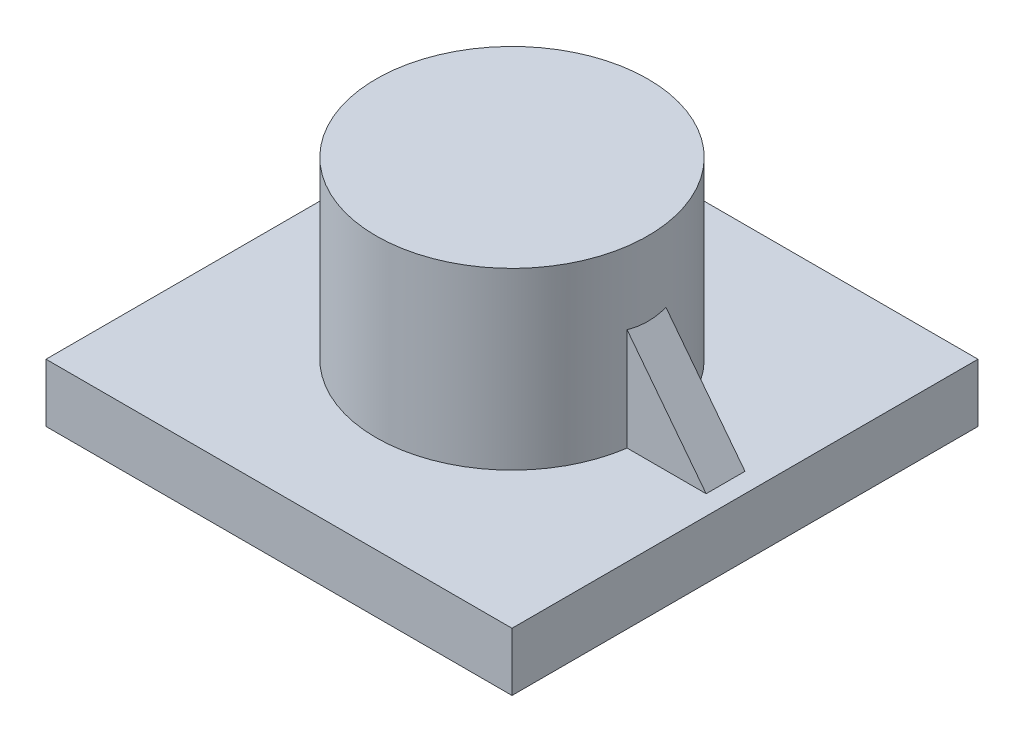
ISO-10303-21;
HEADER;
FILE_DESCRIPTION(('STEP AP214'),'2;1');
FILE_NAME('part.step','',(''),(''),'','','');
FILE_SCHEMA(('AUTOMOTIVE_DESIGN { 1 0 10303 214 1 1 1 1 }'));
ENDSEC;
DATA;
#1=APPLICATION_CONTEXT('core data for automotive mechanical design processes');
#2=APPLICATION_PROTOCOL_DEFINITION('international standard','automotive_design',2000,#1);
#3=PRODUCT_CONTEXT('',#1,'mechanical');
#4=PRODUCT('Part','Part','',(#3));
#5=PRODUCT_RELATED_PRODUCT_CATEGORY('part','',(#4));
#6=PRODUCT_DEFINITION_FORMATION('','',#4);
#7=PRODUCT_DEFINITION_CONTEXT('part definition',#1,'design');
#8=PRODUCT_DEFINITION('design','',#6,#7);
#9=PRODUCT_DEFINITION_SHAPE('','',#8);
#10=(LENGTH_UNIT() NAMED_UNIT(*) SI_UNIT(.MILLI.,.METRE.));
#11=(NAMED_UNIT(*) PLANE_ANGLE_UNIT() SI_UNIT($,.RADIAN.));
#12=(NAMED_UNIT(*) SI_UNIT($,.STERADIAN.) SOLID_ANGLE_UNIT());
#13=UNCERTAINTY_MEASURE_WITH_UNIT(LENGTH_MEASURE(1.E-05),#10,'distance_accuracy_value','');
#14=(GEOMETRIC_REPRESENTATION_CONTEXT(3) GLOBAL_UNCERTAINTY_ASSIGNED_CONTEXT((#13)) GLOBAL_UNIT_ASSIGNED_CONTEXT((#10,
#11,#12)) REPRESENTATION_CONTEXT('',''));
#15=CARTESIAN_POINT('',(0.,0.,0.));
#16=DIRECTION('',(0.,0.,1.));
#17=DIRECTION('',(1.,0.,0.));
#18=AXIS2_PLACEMENT_3D('',#15,#16,#17);
#19=CARTESIAN_POINT('',(0.,60.,0.));
#20=DIRECTION('',(0.,-1.,0.));
#21=DIRECTION('',(0.,0.,-1.));
#22=AXIS2_PLACEMENT_3D('',#19,#20,#21);
#23=CYLINDRICAL_SURFACE('',#22,35.);
#24=CARTESIAN_POINT('',(0.,60.,0.));
#25=DIRECTION('',(0.,1.,0.));
#26=DIRECTION('',(0.,0.,1.));
#27=AXIS2_PLACEMENT_3D('',#24,#25,#26);
#28=CIRCLE('',#27,35.);
#29=CARTESIAN_POINT('',(0.,60.,35.));
#30=VERTEX_POINT('',#29);
#31=EDGE_CURVE('E120',#30,#30,#28,.T.);
#32=ORIENTED_EDGE('',*,*,#31,.F.);
#33=EDGE_LOOP('',(#32));
#34=FACE_BOUND('',#33,.T.);
#35=DIRECTION('',(0.,-1.,0.));
#36=VECTOR('',#35,1.);
#37=CARTESIAN_POINT('',(34.6410161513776,60.,-5.));
#38=LINE('',#37,#36);
#39=CARTESIAN_POINT('',(34.6410161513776,15.,-5.));
#40=VERTEX_POINT('',#39);
#41=CARTESIAN_POINT('',(34.6410161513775,41.3912753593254,-5.));
#42=VERTEX_POINT('',#41);
#43=EDGE_CURVE('E11',#40,#42,#38,.F.);
#44=ORIENTED_EDGE('',*,*,#43,.F.);
#45=CARTESIAN_POINT('',(0.,15.,0.));
#46=DIRECTION('',(0.,1.,0.));
#47=DIRECTION('',(0.,0.,1.));
#48=AXIS2_PLACEMENT_3D('',#45,#46,#47);
#49=CIRCLE('',#48,35.);
#50=CARTESIAN_POINT('',(34.6410161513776,15.,5.));
#51=VERTEX_POINT('',#50);
#52=EDGE_CURVE('E130',#51,#40,#49,.F.);
#53=ORIENTED_EDGE('',*,*,#52,.F.);
#54=DIRECTION('',(0.,-1.,0.));
#55=VECTOR('',#54,1.);
#56=CARTESIAN_POINT('',(34.6410161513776,60.,5.));
#57=LINE('',#56,#55);
#58=CARTESIAN_POINT('',(34.6410161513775,41.3912753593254,5.));
#59=VERTEX_POINT('',#58);
#60=EDGE_CURVE('E157',#51,#59,#57,.F.);
#61=ORIENTED_EDGE('',*,*,#60,.T.);
#62=CARTESIAN_POINT('',(0.,86.2962962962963,0.));
#63=DIRECTION('',(0.791782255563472,0.610803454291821,0.));
#64=DIRECTION('',(0.610803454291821,-0.791782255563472,0.));
#65=AXIS2_PLACEMENT_3D('',#62,#63,#64);
#66=ELLIPSE('',#65,57.3015750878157,35.);
#67=EDGE_CURVE('E47',#59,#42,#66,.T.);
#68=ORIENTED_EDGE('',*,*,#67,.T.);
#69=EDGE_LOOP('',(#44,#53,#61,#68));
#70=FACE_BOUND('',#69,.T.);
#71=ADVANCED_FACE('F41',(#34,#70),#23,.T.);
#72=CARTESIAN_POINT('',(-60.,15.,-60.));
#73=DIRECTION('',(1.,0.,0.));
#74=DIRECTION('',(0.,0.,-1.));
#75=AXIS2_PLACEMENT_3D('',#72,#73,#74);
#76=PLANE('',#75);
#77=DIRECTION('',(0.,0.,1.));
#78=VECTOR('',#77,1.);
#79=CARTESIAN_POINT('',(-60.,0.,-60.));
#80=LINE('',#79,#78);
#81=CARTESIAN_POINT('',(-60.,0.,-60.));
#82=VERTEX_POINT('',#81);
#83=CARTESIAN_POINT('',(-60.,0.,60.));
#84=VERTEX_POINT('',#83);
#85=EDGE_CURVE('E137',#82,#84,#80,.T.);
#86=ORIENTED_EDGE('',*,*,#85,.T.);
#87=DIRECTION('',(0.,-1.,0.));
#88=VECTOR('',#87,1.);
#89=CARTESIAN_POINT('',(-60.,15.,60.));
#90=LINE('',#89,#88);
#91=CARTESIAN_POINT('',(-60.,15.,60.));
#92=VERTEX_POINT('',#91);
#93=EDGE_CURVE('E160',#92,#84,#90,.T.);
#94=ORIENTED_EDGE('',*,*,#93,.F.);
#95=DIRECTION('',(0.,0.,1.));
#96=VECTOR('',#95,1.);
#97=CARTESIAN_POINT('',(-60.,15.,-60.));
#98=LINE('',#97,#96);
#99=CARTESIAN_POINT('',(-60.,15.,-60.));
#100=VERTEX_POINT('',#99);
#101=EDGE_CURVE('E140',#100,#92,#98,.T.);
#102=ORIENTED_EDGE('',*,*,#101,.F.);
#103=DIRECTION('',(0.,-1.,0.));
#104=VECTOR('',#103,1.);
#105=CARTESIAN_POINT('',(-60.,15.,-60.));
#106=LINE('',#105,#104);
#107=EDGE_CURVE('E141',#100,#82,#106,.T.);
#108=ORIENTED_EDGE('',*,*,#107,.T.);
#109=EDGE_LOOP('',(#86,#94,#102,#108));
#110=FACE_BOUND('',#109,.T.);
#111=ADVANCED_FACE('F43',(#110),#76,.F.);
#112=CARTESIAN_POINT('',(-60.,15.,60.));
#113=DIRECTION('',(0.,0.,-1.));
#114=DIRECTION('',(-1.,0.,0.));
#115=AXIS2_PLACEMENT_3D('',#112,#113,#114);
#116=PLANE('',#115);
#117=DIRECTION('',(1.,0.,0.));
#118=VECTOR('',#117,1.);
#119=CARTESIAN_POINT('',(-60.,0.,60.));
#120=LINE('',#119,#118);
#121=CARTESIAN_POINT('',(60.,0.,60.));
#122=VERTEX_POINT('',#121);
#123=EDGE_CURVE('E148',#84,#122,#120,.T.);
#124=ORIENTED_EDGE('',*,*,#123,.T.);
#125=DIRECTION('',(0.,-1.,0.));
#126=VECTOR('',#125,1.);
#127=CARTESIAN_POINT('',(60.,15.,60.));
#128=LINE('',#127,#126);
#129=CARTESIAN_POINT('',(60.,15.,60.));
#130=VERTEX_POINT('',#129);
#131=EDGE_CURVE('E152',#130,#122,#128,.T.);
#132=ORIENTED_EDGE('',*,*,#131,.F.);
#133=DIRECTION('',(1.,0.,0.));
#134=VECTOR('',#133,1.);
#135=CARTESIAN_POINT('',(-60.,15.,60.));
#136=LINE('',#135,#134);
#137=EDGE_CURVE('E94',#92,#130,#136,.T.);
#138=ORIENTED_EDGE('',*,*,#137,.F.);
#139=ORIENTED_EDGE('',*,*,#93,.T.);
#140=EDGE_LOOP('',(#124,#132,#138,#139));
#141=FACE_BOUND('',#140,.T.);
#142=ADVANCED_FACE('F178',(#141),#116,.F.);
#143=CARTESIAN_POINT('',(60.,15.,60.));
#144=DIRECTION('',(-1.,0.,0.));
#145=DIRECTION('',(0.,0.,1.));
#146=AXIS2_PLACEMENT_3D('',#143,#144,#145);
#147=PLANE('',#146);
#148=DIRECTION('',(0.,0.,-1.));
#149=VECTOR('',#148,1.);
#150=CARTESIAN_POINT('',(60.,0.,60.));
#151=LINE('',#150,#149);
#152=CARTESIAN_POINT('',(60.,0.,-60.));
#153=VERTEX_POINT('',#152);
#154=EDGE_CURVE('E146',#122,#153,#151,.T.);
#155=ORIENTED_EDGE('',*,*,#154,.T.);
#156=DIRECTION('',(0.,-1.,0.));
#157=VECTOR('',#156,1.);
#158=CARTESIAN_POINT('',(60.,15.,-60.));
#159=LINE('',#158,#157);
#160=CARTESIAN_POINT('',(60.,15.,-60.));
#161=VERTEX_POINT('',#160);
#162=EDGE_CURVE('E155',#161,#153,#159,.T.);
#163=ORIENTED_EDGE('',*,*,#162,.F.);
#164=DIRECTION('',(0.,0.,-1.));
#165=VECTOR('',#164,1.);
#166=CARTESIAN_POINT('',(60.,15.,60.));
#167=LINE('',#166,#165);
#168=EDGE_CURVE('E138',#130,#161,#167,.T.);
#169=ORIENTED_EDGE('',*,*,#168,.F.);
#170=ORIENTED_EDGE('',*,*,#131,.T.);
#171=EDGE_LOOP('',(#155,#163,#169,#170));
#172=FACE_BOUND('',#171,.T.);
#173=ADVANCED_FACE('F194',(#172),#147,.F.);
#174=CARTESIAN_POINT('',(60.,15.,-60.));
#175=DIRECTION('',(0.,0.,1.));
#176=DIRECTION('',(1.,0.,0.));
#177=AXIS2_PLACEMENT_3D('',#174,#175,#176);
#178=PLANE('',#177);
#179=DIRECTION('',(-1.,0.,0.));
#180=VECTOR('',#179,1.);
#181=CARTESIAN_POINT('',(60.,0.,-60.));
#182=LINE('',#181,#180);
#183=EDGE_CURVE('E88',#153,#82,#182,.T.);
#184=ORIENTED_EDGE('',*,*,#183,.T.);
#185=ORIENTED_EDGE('',*,*,#107,.F.);
#186=DIRECTION('',(-1.,0.,0.));
#187=VECTOR('',#186,1.);
#188=CARTESIAN_POINT('',(60.,15.,-60.));
#189=LINE('',#188,#187);
#190=EDGE_CURVE('E62',#161,#100,#189,.T.);
#191=ORIENTED_EDGE('',*,*,#190,.F.);
#192=ORIENTED_EDGE('',*,*,#162,.T.);
#193=EDGE_LOOP('',(#184,#185,#191,#192));
#194=FACE_BOUND('',#193,.T.);
#195=ADVANCED_FACE('F190',(#194),#178,.F.);
#196=CARTESIAN_POINT('',(0.,15.,0.));
#197=DIRECTION('',(0.,1.,0.));
#198=DIRECTION('',(0.,0.,1.));
#199=AXIS2_PLACEMENT_3D('',#196,#197,#198);
#200=PLANE('',#199);
#201=DIRECTION('',(1.,0.,0.));
#202=VECTOR('',#201,1.);
#203=CARTESIAN_POINT('',(28.,15.,5.));
#204=LINE('',#203,#202);
#205=CARTESIAN_POINT('',(55.,15.,5.));
#206=VERTEX_POINT('',#205);
#207=EDGE_CURVE('E129',#51,#206,#204,.T.);
#208=ORIENTED_EDGE('',*,*,#207,.F.);
#209=ORIENTED_EDGE('',*,*,#52,.T.);
#210=DIRECTION('',(1.,0.,0.));
#211=VECTOR('',#210,1.);
#212=CARTESIAN_POINT('',(28.,15.,-5.));
#213=LINE('',#212,#211);
#214=CARTESIAN_POINT('',(55.,15.,-5.));
#215=VERTEX_POINT('',#214);
#216=EDGE_CURVE('E122',#40,#215,#213,.T.);
#217=ORIENTED_EDGE('',*,*,#216,.T.);
#218=DIRECTION('',(0.,0.,1.));
#219=VECTOR('',#218,1.);
#220=CARTESIAN_POINT('',(55.,15.,-5.));
#221=LINE('',#220,#219);
#222=EDGE_CURVE('E108',#215,#206,#221,.T.);
#223=ORIENTED_EDGE('',*,*,#222,.T.);
#224=EDGE_LOOP('',(#208,#209,#217,#223));
#225=FACE_BOUND('',#224,.T.);
#226=ORIENTED_EDGE('',*,*,#101,.T.);
#227=ORIENTED_EDGE('',*,*,#137,.T.);
#228=ORIENTED_EDGE('',*,*,#168,.T.);
#229=ORIENTED_EDGE('',*,*,#190,.T.);
#230=EDGE_LOOP('',(#226,#227,#228,#229));
#231=FACE_BOUND('',#230,.T.);
#232=ADVANCED_FACE('F123',(#225,#231),#200,.T.);
#233=CARTESIAN_POINT('',(0.,0.,0.));
#234=DIRECTION('',(0.,1.,0.));
#235=DIRECTION('',(0.,0.,1.));
#236=AXIS2_PLACEMENT_3D('',#233,#234,#235);
#237=PLANE('',#236);
#238=ORIENTED_EDGE('',*,*,#85,.F.);
#239=ORIENTED_EDGE('',*,*,#183,.F.);
#240=ORIENTED_EDGE('',*,*,#154,.F.);
#241=ORIENTED_EDGE('',*,*,#123,.F.);
#242=EDGE_LOOP('',(#238,#239,#240,#241));
#243=FACE_BOUND('',#242,.T.);
#244=ADVANCED_FACE('F188',(#243),#237,.F.);
#245=CARTESIAN_POINT('',(0.,60.,0.));
#246=DIRECTION('',(0.,1.,0.));
#247=DIRECTION('',(0.,0.,1.));
#248=AXIS2_PLACEMENT_3D('',#245,#246,#247);
#249=PLANE('',#248);
#250=ORIENTED_EDGE('',*,*,#31,.T.);
#251=EDGE_LOOP('',(#250));
#252=FACE_BOUND('',#251,.T.);
#253=ADVANCED_FACE('F168',(#252),#249,.T.);
#254=CARTESIAN_POINT('',(0.,0.,-5.));
#255=DIRECTION('',(0.,0.,1.));
#256=DIRECTION('',(1.,0.,0.));
#257=AXIS2_PLACEMENT_3D('',#254,#255,#256);
#258=PLANE('',#257);
#259=ORIENTED_EDGE('',*,*,#216,.F.);
#260=ORIENTED_EDGE('',*,*,#43,.T.);
#261=DIRECTION('',(-0.610803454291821,0.791782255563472,0.));
#262=VECTOR('',#261,1.);
#263=CARTESIAN_POINT('',(55.,15.,-5.));
#264=LINE('',#263,#262);
#265=EDGE_CURVE('E115',#215,#42,#264,.T.);
#266=ORIENTED_EDGE('',*,*,#265,.F.);
#267=EDGE_LOOP('',(#259,#260,#266));
#268=FACE_BOUND('',#267,.T.);
#269=ADVANCED_FACE('F117',(#268),#258,.F.);
#270=CARTESIAN_POINT('',(0.,0.,5.));
#271=DIRECTION('',(0.,0.,1.));
#272=DIRECTION('',(1.,0.,0.));
#273=AXIS2_PLACEMENT_3D('',#270,#271,#272);
#274=PLANE('',#273);
#275=ORIENTED_EDGE('',*,*,#60,.F.);
#276=ORIENTED_EDGE('',*,*,#207,.T.);
#277=DIRECTION('',(-0.610803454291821,0.791782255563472,0.));
#278=VECTOR('',#277,1.);
#279=CARTESIAN_POINT('',(55.,15.,5.));
#280=LINE('',#279,#278);
#281=EDGE_CURVE('E57',#206,#59,#280,.T.);
#282=ORIENTED_EDGE('',*,*,#281,.T.);
#283=EDGE_LOOP('',(#275,#276,#282));
#284=FACE_BOUND('',#283,.T.);
#285=ADVANCED_FACE('F165',(#284),#274,.T.);
#286=CARTESIAN_POINT('',(55.,15.,-5.));
#287=DIRECTION('',(0.791782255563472,0.610803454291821,0.));
#288=DIRECTION('',(-0.610803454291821,0.791782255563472,0.));
#289=AXIS2_PLACEMENT_3D('',#286,#287,#288);
#290=PLANE('',#289);
#291=ORIENTED_EDGE('',*,*,#67,.F.);
#292=ORIENTED_EDGE('',*,*,#281,.F.);
#293=ORIENTED_EDGE('',*,*,#222,.F.);
#294=ORIENTED_EDGE('',*,*,#265,.T.);
#295=EDGE_LOOP('',(#291,#292,#293,#294));
#296=FACE_BOUND('',#295,.T.);
#297=ADVANCED_FACE('F112',(#296),#290,.T.);
#298=CLOSED_SHELL('',(#71,#111,#142,#173,#195,#232,#244,#253,#269,#285,#297));
#299=MANIFOLD_SOLID_BREP('B2',#298);
#300=ADVANCED_BREP_SHAPE_REPRESENTATION('',(#18,#299),#14);
#301=SHAPE_DEFINITION_REPRESENTATION(#9,#300);
ENDSEC;
END-ISO-10303-21;
